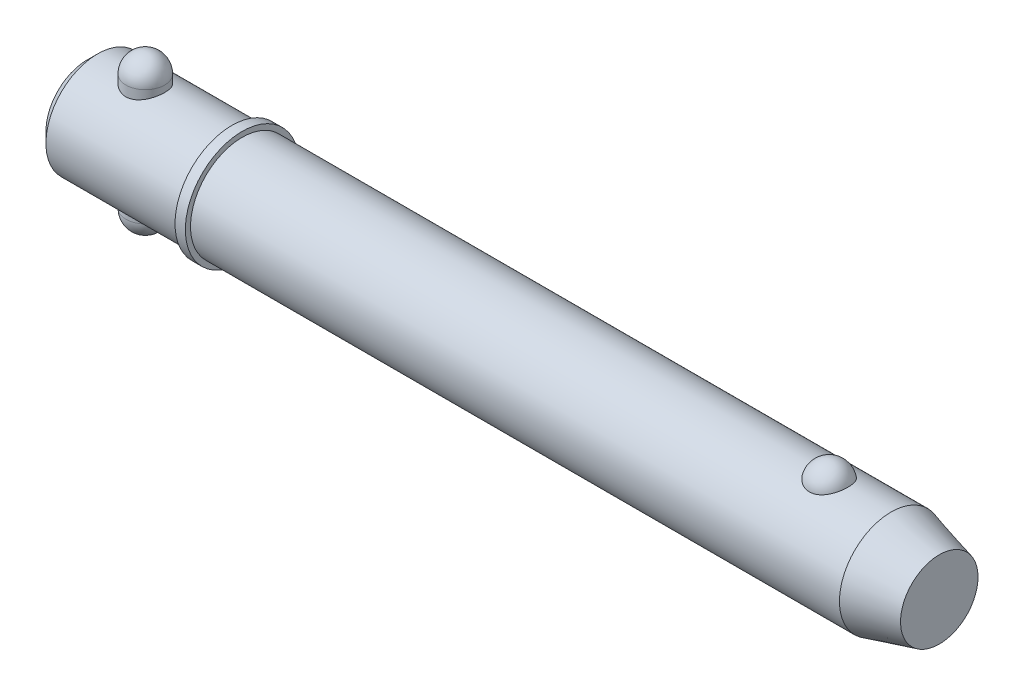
ISO-10303-21;
HEADER;
FILE_DESCRIPTION(('STEP AP214'),'2;1');
FILE_NAME('part.step','',(''),(''),'','','');
FILE_SCHEMA(('AUTOMOTIVE_DESIGN { 1 0 10303 214 1 1 1 1 }'));
ENDSEC;
DATA;
#1=APPLICATION_CONTEXT('core data for automotive mechanical design processes');
#2=APPLICATION_PROTOCOL_DEFINITION('international standard','automotive_design',2000,#1);
#3=PRODUCT_CONTEXT('',#1,'mechanical');
#4=PRODUCT('Part','Part','',(#3));
#5=PRODUCT_RELATED_PRODUCT_CATEGORY('part','',(#4));
#6=PRODUCT_DEFINITION_FORMATION('','',#4);
#7=PRODUCT_DEFINITION_CONTEXT('part definition',#1,'design');
#8=PRODUCT_DEFINITION('design','',#6,#7);
#9=PRODUCT_DEFINITION_SHAPE('','',#8);
#10=(LENGTH_UNIT() NAMED_UNIT(*) SI_UNIT(.MILLI.,.METRE.));
#11=(NAMED_UNIT(*) PLANE_ANGLE_UNIT() SI_UNIT($,.RADIAN.));
#12=(NAMED_UNIT(*) SI_UNIT($,.STERADIAN.) SOLID_ANGLE_UNIT());
#13=UNCERTAINTY_MEASURE_WITH_UNIT(LENGTH_MEASURE(1.E-05),#10,'distance_accuracy_value','');
#14=(GEOMETRIC_REPRESENTATION_CONTEXT(3) GLOBAL_UNCERTAINTY_ASSIGNED_CONTEXT((#13)) GLOBAL_UNIT_ASSIGNED_CONTEXT((#10,
#11,#12)) REPRESENTATION_CONTEXT('',''));
#15=CARTESIAN_POINT('',(0.,0.,0.));
#16=DIRECTION('',(0.,0.,1.));
#17=DIRECTION('',(1.,0.,0.));
#18=AXIS2_PLACEMENT_3D('',#15,#16,#17);
#19=CARTESIAN_POINT('',(14.28,19.05,0.));
#20=DIRECTION('',(0.,-1.,0.));
#21=DIRECTION('',(0.,0.,-1.));
#22=AXIS2_PLACEMENT_3D('',#19,#20,#21);
#23=CYLINDRICAL_SURFACE('',#22,4.76);
#24=CARTESIAN_POINT('',(14.28,-14.29,0.));
#25=DIRECTION('',(0.,-1.,0.));
#26=DIRECTION('',(0.,0.,-1.));
#27=AXIS2_PLACEMENT_3D('',#24,#25,#26);
#28=CIRCLE('',#27,4.76);
#29=CARTESIAN_POINT('',(14.28,-14.29,-4.76));
#30=VERTEX_POINT('',#29);
#31=EDGE_CURVE('P0_E10',#30,#30,#28,.F.);
#32=CARTESIAN_POINT('',(14.28,14.29,0.));
#33=DIRECTION('',(0.,-1.,0.));
#34=DIRECTION('',(0.,0.,-1.));
#35=AXIS2_PLACEMENT_3D('',#32,#33,#34);
#36=CIRCLE('',#35,4.76);
#37=CARTESIAN_POINT('',(14.28,14.29,-4.76));
#38=VERTEX_POINT('',#37);
#39=EDGE_CURVE('P0_E21',#38,#38,#36,.T.);
#40=CARTESIAN_POINT('',(14.28,-14.29,-4.76));
#41=CARTESIAN_POINT('',(14.28,-13.9922916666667,-4.76));
#42=CARTESIAN_POINT('',(14.28,-13.6945833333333,-4.76));
#43=CARTESIAN_POINT('',(14.28,-13.0991666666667,-4.76));
#44=CARTESIAN_POINT('',(14.28,-12.8014583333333,-4.76));
#45=CARTESIAN_POINT('',(14.28,-12.2060416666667,-4.76));
#46=CARTESIAN_POINT('',(14.28,-11.9083333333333,-4.76));
#47=CARTESIAN_POINT('',(14.28,-11.3129166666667,-4.76));
#48=CARTESIAN_POINT('',(14.28,-11.0152083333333,-4.76));
#49=CARTESIAN_POINT('',(14.28,-10.4197916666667,-4.76));
#50=CARTESIAN_POINT('',(14.28,-10.1220833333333,-4.76));
#51=CARTESIAN_POINT('',(14.28,-9.52666666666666,-4.76));
#52=CARTESIAN_POINT('',(14.28,-9.22895833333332,-4.76));
#53=CARTESIAN_POINT('',(14.28,-8.63354166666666,-4.76));
#54=CARTESIAN_POINT('',(14.28,-8.33583333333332,-4.76));
#55=CARTESIAN_POINT('',(14.28,-7.74041666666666,-4.76));
#56=CARTESIAN_POINT('',(14.28,-7.44270833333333,-4.76));
#57=CARTESIAN_POINT('',(14.28,-6.84729166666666,-4.76));
#58=CARTESIAN_POINT('',(14.28,-6.54958333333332,-4.76));
#59=CARTESIAN_POINT('',(14.28,-5.95416666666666,-4.76));
#60=CARTESIAN_POINT('',(14.28,-5.65645833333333,-4.76));
#61=CARTESIAN_POINT('',(14.28,-5.06104166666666,-4.76));
#62=CARTESIAN_POINT('',(14.28,-4.76333333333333,-4.76));
#63=CARTESIAN_POINT('',(14.28,-4.16791666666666,-4.76));
#64=CARTESIAN_POINT('',(14.28,-3.87020833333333,-4.76));
#65=CARTESIAN_POINT('',(14.28,-3.27479166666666,-4.76));
#66=CARTESIAN_POINT('',(14.28,-2.97708333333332,-4.76));
#67=CARTESIAN_POINT('',(14.28,-2.38166666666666,-4.76));
#68=CARTESIAN_POINT('',(14.28,-2.08395833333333,-4.76));
#69=CARTESIAN_POINT('',(14.28,-1.48854166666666,-4.76));
#70=CARTESIAN_POINT('',(14.28,-1.19083333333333,-4.76));
#71=CARTESIAN_POINT('',(14.28,-0.595416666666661,-4.76));
#72=CARTESIAN_POINT('',(14.28,-0.297708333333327,-4.76));
#73=CARTESIAN_POINT('',(14.28,0.297708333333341,-4.76));
#74=CARTESIAN_POINT('',(14.28,0.595416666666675,-4.76));
#75=CARTESIAN_POINT('',(14.28,1.19083333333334,-4.76));
#76=CARTESIAN_POINT('',(14.28,1.48854166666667,-4.76));
#77=CARTESIAN_POINT('',(14.28,2.08395833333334,-4.76));
#78=CARTESIAN_POINT('',(14.28,2.38166666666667,-4.76));
#79=CARTESIAN_POINT('',(14.28,2.97708333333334,-4.76));
#80=CARTESIAN_POINT('',(14.28,3.27479166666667,-4.76));
#81=CARTESIAN_POINT('',(14.28,3.87020833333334,-4.76));
#82=CARTESIAN_POINT('',(14.28,4.16791666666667,-4.76));
#83=CARTESIAN_POINT('',(14.28,4.76333333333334,-4.76));
#84=CARTESIAN_POINT('',(14.28,5.06104166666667,-4.76));
#85=CARTESIAN_POINT('',(14.28,5.65645833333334,-4.76));
#86=CARTESIAN_POINT('',(14.28,5.95416666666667,-4.76));
#87=CARTESIAN_POINT('',(14.28,6.54958333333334,-4.76));
#88=CARTESIAN_POINT('',(14.28,6.84729166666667,-4.76));
#89=CARTESIAN_POINT('',(14.28,7.44270833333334,-4.76));
#90=CARTESIAN_POINT('',(14.28,7.74041666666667,-4.76));
#91=CARTESIAN_POINT('',(14.28,8.33583333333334,-4.76));
#92=CARTESIAN_POINT('',(14.28,8.63354166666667,-4.76));
#93=CARTESIAN_POINT('',(14.28,9.22895833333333,-4.76));
#94=CARTESIAN_POINT('',(14.28,9.52666666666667,-4.76));
#95=CARTESIAN_POINT('',(14.28,10.1220833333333,-4.76));
#96=CARTESIAN_POINT('',(14.28,10.4197916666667,-4.76));
#97=CARTESIAN_POINT('',(14.28,11.0152083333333,-4.76));
#98=CARTESIAN_POINT('',(14.28,11.3129166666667,-4.76));
#99=CARTESIAN_POINT('',(14.28,11.9083333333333,-4.76));
#100=CARTESIAN_POINT('',(14.28,12.2060416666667,-4.76));
#101=CARTESIAN_POINT('',(14.28,12.8014583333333,-4.76));
#102=CARTESIAN_POINT('',(14.28,13.0991666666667,-4.76));
#103=CARTESIAN_POINT('',(14.28,13.6945833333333,-4.76));
#104=CARTESIAN_POINT('',(14.28,13.9922916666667,-4.76));
#105=CARTESIAN_POINT('',(14.28,14.29,-4.76));
#106=B_SPLINE_CURVE_WITH_KNOTS('',3,(#40,#41,#42,#43,#44,#45,#46,#47,#48,#49,#50,#51,#52,#53,
#54,#55,#56,#57,#58,#59,#60,#61,#62,#63,#64,#65,#66,#67,#68,#69,#70,#71,#72,#73,#74,#75,#76,#77,
#78,#79,#80,#81,#82,#83,#84,#85,#86,#87,#88,#89,#90,#91,#92,#93,#94,#95,#96,#97,#98,#99,#100,
#101,#102,#103,#104,#105),.UNSPECIFIED.,.F.,.F.,(4,2,2,2,2,2,2,2,2,2,2,2,2,2,2,2,2,2,2,2,2,2,2,
2,2,2,2,2,2,2,2,2,4),(0.,0.893125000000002,1.78625,2.67937499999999,3.5725,4.465625,5.35875,
6.25187499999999,7.145,8.038125,8.93125,9.82437499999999,10.7175,11.610625,12.50375,13.396875,
14.29,15.183125,16.07625,16.969375,17.8625,18.755625,19.64875,20.541875,21.435,22.328125,
23.22125,24.114375,25.0075,25.900625,26.79375,27.686875,28.58),.UNSPECIFIED.);
#107=EDGE_CURVE('P0_BSEAM14',#30,#38,#106,.T.);
#108=ORIENTED_EDGE('',*,*,#31,.T.);
#109=ORIENTED_EDGE('',*,*,#39,.T.);
#110=ORIENTED_EDGE('',*,*,#107,.T.);
#111=ORIENTED_EDGE('',*,*,#107,.F.);
#112=EDGE_LOOP('',(#108,#110,#109,#111));
#113=FACE_BOUND('',#112,.T.);
#114=ADVANCED_FACE('P0_F14',(#113),#23,.T.);
#115=CARTESIAN_POINT('',(14.28,-14.29,0.));
#116=DIRECTION('',(0.,0.,1.));
#117=DIRECTION('',(1.,0.,0.));
#118=AXIS2_PLACEMENT_3D('',#115,#116,#117);
#119=SPHERICAL_SURFACE('',#118,4.76);
#120=CARTESIAN_POINT('',(14.28,-14.29,0.));
#121=DIRECTION('',(0.,-1.,0.));
#122=DIRECTION('',(0.,0.,-1.));
#123=AXIS2_PLACEMENT_3D('',#120,#121,#122);
#124=SPHERICAL_SURFACE('',#123,4.76);
#125=ORIENTED_EDGE('',*,*,#31,.F.);
#126=EDGE_LOOP('',(#125));
#127=FACE_BOUND('',#126,.T.);
#128=ADVANCED_FACE('P0_F29',(#127),#124,.T.);
#129=CARTESIAN_POINT('',(14.28,14.29,0.));
#130=DIRECTION('',(0.,0.,1.));
#131=DIRECTION('',(1.,0.,0.));
#132=AXIS2_PLACEMENT_3D('',#129,#130,#131);
#133=SPHERICAL_SURFACE('',#132,4.76);
#134=CARTESIAN_POINT('',(14.28,14.29,0.));
#135=DIRECTION('',(0.,-1.,0.));
#136=DIRECTION('',(0.,0.,-1.));
#137=AXIS2_PLACEMENT_3D('',#134,#135,#136);
#138=SPHERICAL_SURFACE('',#137,4.76);
#139=ORIENTED_EDGE('',*,*,#39,.F.);
#140=EDGE_LOOP('',(#139));
#141=FACE_BOUND('',#140,.T.);
#142=ADVANCED_FACE('P0_F16',(#141),#138,.T.);
#143=CLOSED_SHELL('',(#114,#128,#142));
#144=MANIFOLD_SOLID_BREP('P0_B1',#143);
#145=CARTESIAN_POINT('',(0.,0.,0.));
#146=DIRECTION('',(1.,0.,0.));
#147=DIRECTION('',(0.,0.,-1.));
#148=AXIS2_PLACEMENT_3D('',#145,#146,#147);
#149=CYLINDRICAL_SURFACE('',#148,12.7);
#150=CARTESIAN_POINT('',(197.700738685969,0.,0.));
#151=DIRECTION('',(1.,0.,0.));
#152=DIRECTION('',(0.,0.,-1.));
#153=AXIS2_PLACEMENT_3D('',#150,#151,#152);
#154=CIRCLE('',#153,12.7);
#155=CARTESIAN_POINT('',(197.700738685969,0.,-12.7));
#156=VERTEX_POINT('',#155);
#157=EDGE_CURVE('P1_E81',#156,#156,#154,.T.);
#158=ORIENTED_EDGE('',*,*,#157,.F.);
#159=EDGE_LOOP('',(#158));
#160=FACE_BOUND('',#159,.T.);
#161=CARTESIAN_POINT('',(38.1,0.,0.));
#162=DIRECTION('',(1.,0.,0.));
#163=DIRECTION('',(0.,0.,-1.));
#164=AXIS2_PLACEMENT_3D('',#161,#162,#163);
#165=CIRCLE('',#164,12.7);
#166=CARTESIAN_POINT('',(38.1,0.,-12.7));
#167=VERTEX_POINT('',#166);
#168=EDGE_CURVE('P1_E85',#167,#167,#165,.T.);
#169=ORIENTED_EDGE('',*,*,#168,.T.);
#170=EDGE_LOOP('',(#169));
#171=FACE_BOUND('',#170,.T.);
#172=CARTESIAN_POINT('',(182.460042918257,11.7500437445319,4.81938502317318));
#173=CARTESIAN_POINT('',(182.335088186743,11.7500430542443,4.81938571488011));
#174=CARTESIAN_POINT('',(182.210144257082,11.7520975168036,4.81438658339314));
#175=CARTESIAN_POINT('',(181.961142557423,11.760253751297,4.79442904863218));
#176=CARTESIAN_POINT('',(181.837085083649,11.7663568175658,4.77946746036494));
#177=CARTESIAN_POINT('',(181.590901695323,11.7824262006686,4.73971414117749));
#178=CARTESIAN_POINT('',(181.468774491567,11.7923898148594,4.71492928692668));
#179=CARTESIAN_POINT('',(181.227187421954,11.8158938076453,4.65571340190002));
#180=CARTESIAN_POINT('',(181.10772859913,11.8294355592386,4.6212786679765));
#181=CARTESIAN_POINT('',(180.872557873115,11.8596812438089,4.54309502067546));
#182=CARTESIAN_POINT('',(180.756839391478,11.8763792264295,4.49936361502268));
#183=CARTESIAN_POINT('',(180.529653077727,11.9124878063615,4.40287235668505));
#184=CARTESIAN_POINT('',(180.418186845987,11.9318994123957,4.35010914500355));
#185=CARTESIAN_POINT('',(180.091278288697,11.9934256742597,4.17881316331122));
#186=CARTESIAN_POINT('',(179.883127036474,12.038858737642,4.04720756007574));
#187=CARTESIAN_POINT('',(179.485850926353,12.1352173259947,3.748564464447));
#188=CARTESIAN_POINT('',(179.297443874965,12.1862630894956,3.58061821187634));
#189=CARTESIAN_POINT('',(178.950521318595,12.2875163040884,3.21600758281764));
#190=CARTESIAN_POINT('',(178.792011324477,12.3377235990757,3.01933792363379));
#191=CARTESIAN_POINT('',(178.50168878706,12.4344923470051,2.592916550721));
#192=CARTESIAN_POINT('',(178.371376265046,12.4807925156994,2.36208286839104));
#193=CARTESIAN_POINT('',(178.149407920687,12.5623454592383,1.88070399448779));
#194=CARTESIAN_POINT('',(178.057755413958,12.5975972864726,1.63015711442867));
#195=CARTESIAN_POINT('',(177.914046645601,12.6538414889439,1.1129886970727));
#196=CARTESIAN_POINT('',(177.862499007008,12.6746503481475,0.846205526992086));
#197=CARTESIAN_POINT('',(177.801977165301,12.699153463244,0.307085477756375));
#198=CARTESIAN_POINT('',(177.793001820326,12.7028481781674,0.0347487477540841));
#199=CARTESIAN_POINT('',(177.817731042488,12.6927785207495,-0.506073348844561));
#200=CARTESIAN_POINT('',(177.851189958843,12.6791146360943,-0.774571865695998));
#201=CARTESIAN_POINT('',(177.959687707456,12.635882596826,-1.30170246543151));
#202=CARTESIAN_POINT('',(178.03472729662,12.606314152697,-1.56033436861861));
#203=CARTESIAN_POINT('',(178.22500006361,12.5342328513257,-2.06083899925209));
#204=CARTESIAN_POINT('',(178.340287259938,12.4917026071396,-2.30268867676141));
#205=CARTESIAN_POINT('',(178.608704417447,12.3981123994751,-2.76259600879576));
#206=CARTESIAN_POINT('',(178.761837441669,12.3470517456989,-2.98065173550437));
#207=CARTESIAN_POINT('',(179.103507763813,12.2416045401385,-3.38786328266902));
#208=CARTESIAN_POINT('',(179.292201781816,12.1872040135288,-3.57688418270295));
#209=CARTESIAN_POINT('',(179.700239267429,12.0814086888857,-3.91941073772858));
#210=CARTESIAN_POINT('',(179.919580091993,12.0300136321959,-4.07291945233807));
#211=CARTESIAN_POINT('',(180.378375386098,11.9373542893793,-4.33691289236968));
#212=CARTESIAN_POINT('',(180.617304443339,11.8958982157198,-4.44824125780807));
#213=CARTESIAN_POINT('',(181.11243761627,11.8268116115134,-4.62881985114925));
#214=CARTESIAN_POINT('',(181.368635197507,11.7991758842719,-4.69808589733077));
#215=CARTESIAN_POINT('',(181.877164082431,11.7622209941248,-4.78983181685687));
#216=CARTESIAN_POINT('',(182.129041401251,11.7520502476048,-4.81449025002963));
#217=CARTESIAN_POINT('',(182.633573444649,11.7485796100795,-4.82295735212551));
#218=CARTESIAN_POINT('',(182.886228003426,11.7552763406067,-4.80677420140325));
#219=CARTESIAN_POINT('',(183.376834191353,11.7842584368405,-4.73525430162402));
#220=CARTESIAN_POINT('',(183.614998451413,11.8060486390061,-4.68116061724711));
#221=CARTESIAN_POINT('',(184.078489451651,11.8622750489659,-4.53678133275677));
#222=CARTESIAN_POINT('',(184.303815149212,11.8967122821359,-4.44649279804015));
#223=CARTESIAN_POINT('',(184.740801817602,11.9754603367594,-4.22987613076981));
#224=CARTESIAN_POINT('',(184.952057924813,12.0199699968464,-4.10280539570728));
#225=CARTESIAN_POINT('',(185.350601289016,12.1138028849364,-3.81685409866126));
#226=CARTESIAN_POINT('',(185.537883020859,12.163127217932,-3.65796622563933));
#227=CARTESIAN_POINT('',(185.893350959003,12.2642343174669,-3.30364864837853));
#228=CARTESIAN_POINT('',(186.060111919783,12.3160165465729,-3.10678783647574));
#229=CARTESIAN_POINT('',(186.359579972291,12.4142566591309,-2.68748409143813));
#230=CARTESIAN_POINT('',(186.492280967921,12.4607135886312,-2.46503658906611));
#231=CARTESIAN_POINT('',(186.724691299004,12.5450236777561,-1.9928951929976));
#232=CARTESIAN_POINT('',(186.823215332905,12.5825557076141,-1.74255918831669));
#233=CARTESIAN_POINT('',(186.979227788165,12.6431720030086,-1.22773734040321));
#234=CARTESIAN_POINT('',(187.036715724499,12.6662560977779,-0.963251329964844));
#235=CARTESIAN_POINT('',(187.109544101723,12.6956486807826,-0.427355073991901));
#236=CARTESIAN_POINT('',(187.124837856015,12.7019385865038,-0.155937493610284));
#237=CARTESIAN_POINT('',(187.112779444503,12.6970201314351,0.385928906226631));
#238=CARTESIAN_POINT('',(187.08542805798,12.6858120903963,0.656377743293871));
#239=CARTESIAN_POINT('',(187.013060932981,12.6568455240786,1.05454017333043));
#240=CARTESIAN_POINT('',(186.983796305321,12.6451962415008,1.185778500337));
#241=CARTESIAN_POINT('',(186.915022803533,12.6181819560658,1.44513808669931));
#242=CARTESIAN_POINT('',(186.875517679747,12.6028183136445,1.57326046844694));
#243=CARTESIAN_POINT('',(186.786439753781,12.568754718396,1.82554978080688));
#244=CARTESIAN_POINT('',(186.736862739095,12.5500533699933,1.94971503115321));
#245=CARTESIAN_POINT('',(186.62792115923,12.5098093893,2.19314370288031));
#246=CARTESIAN_POINT('',(186.568560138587,12.4882677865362,2.31240887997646));
#247=CARTESIAN_POINT('',(186.43997128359,12.4427679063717,2.54593031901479));
#248=CARTESIAN_POINT('',(186.370688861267,12.4187964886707,2.66015396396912));
#249=CARTESIAN_POINT('',(186.222903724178,12.3691892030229,2.88202659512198));
#250=CARTESIAN_POINT('',(186.144404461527,12.3435539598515,2.98967802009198));
#251=CARTESIAN_POINT('',(185.978550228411,12.2912955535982,3.19774385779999));
#252=CARTESIAN_POINT('',(185.891191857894,12.2646720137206,3.298155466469));
#253=CARTESIAN_POINT('',(185.708161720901,12.2111945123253,3.49095035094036));
#254=CARTESIAN_POINT('',(185.612493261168,12.1843406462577,3.58333679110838));
#255=CARTESIAN_POINT('',(185.413627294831,12.1312249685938,3.75922876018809));
#256=CARTESIAN_POINT('',(185.310450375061,12.104961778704,3.84275713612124));
#257=CARTESIAN_POINT('',(185.09701336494,12.0537284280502,4.00056406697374));
#258=CARTESIAN_POINT('',(184.986756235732,12.028757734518,4.07484645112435));
#259=CARTESIAN_POINT('',(184.759755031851,11.9808306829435,4.21367959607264));
#260=CARTESIAN_POINT('',(184.643006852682,11.9578756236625,4.27822410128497));
#261=CARTESIAN_POINT('',(184.40394258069,11.9147184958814,4.39698483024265));
#262=CARTESIAN_POINT('',(184.281628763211,11.894515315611,4.45120522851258));
#263=CARTESIAN_POINT('',(184.022952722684,11.8561129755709,4.55255353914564));
#264=CARTESIAN_POINT('',(183.886223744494,11.8381764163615,4.59884858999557));
#265=CARTESIAN_POINT('',(183.608608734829,11.8069093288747,4.67853897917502));
#266=CARTESIAN_POINT('',(183.467724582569,11.7935767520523,4.71194005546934));
#267=CARTESIAN_POINT('',(183.18309446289,11.7720277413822,4.76552188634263));
#268=CARTESIAN_POINT('',(183.039348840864,11.7638106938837,4.78570422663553));
#269=CARTESIAN_POINT('',(182.750411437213,11.7528195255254,4.81263433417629));
#270=CARTESIAN_POINT('',(182.605219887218,11.7500445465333,4.81938421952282));
#271=CARTESIAN_POINT('',(182.460042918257,11.7500437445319,4.81938502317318));
#272=B_SPLINE_CURVE_WITH_KNOTS('',3,(#172,#173,#174,#175,#176,#177,#178,#179,#180,#181,#182,
#183,#184,#185,#186,#187,#188,#189,#190,#191,#192,#193,#194,#195,#196,#197,#198,#199,#200,#201,
#202,#203,#204,#205,#206,#207,#208,#209,#210,#211,#212,#213,#214,#215,#216,#217,#218,#219,#220,
#221,#222,#223,#224,#225,#226,#227,#228,#229,#230,#231,#232,#233,#234,#235,#236,#237,#238,#239,
#240,#241,#242,#243,#244,#245,#246,#247,#248,#249,#250,#251,#252,#253,#254,#255,#256,#257,#258,
#259,#260,#261,#262,#263,#264,#265,#266,#267,#268,#269,#270,#271),.UNSPECIFIED.,.T.,.F.,(4,2,2,
2,2,2,2,2,2,2,2,2,2,2,2,2,2,2,2,2,2,2,2,2,2,2,2,2,2,2,2,2,2,2,2,2,2,2,2,2,2,2,2,2,2,2,2,2,2,4),
(0.,0.374729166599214,0.749578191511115,1.12416526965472,1.49889629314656,1.87292776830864,
2.24709865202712,2.99481328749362,3.76399449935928,4.53331735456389,5.3368391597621,
6.14042986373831,6.95405296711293,7.76765424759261,8.57656703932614,9.38549455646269,
10.1955119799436,11.0055949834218,11.8193353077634,12.6330054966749,13.4294141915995,
14.2255231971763,14.9815786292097,15.7374826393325,16.4696948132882,17.2019663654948,
17.9501979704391,18.6986017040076,19.484470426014,20.2704797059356,21.0815215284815,
21.8925729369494,22.7045213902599,23.5164550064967,23.9209608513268,24.3253187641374,
24.7298461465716,25.1342272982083,25.54092555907,25.9474719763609,26.3541750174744,
26.7607169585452,27.1661834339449,27.5714814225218,27.9770386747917,28.3824315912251,
28.8181206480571,29.2536155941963,29.6890582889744,30.1244323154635),.UNSPECIFIED.);
#273=CARTESIAN_POINT('',(182.460042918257,11.7500437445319,4.81938502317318));
#274=VERTEX_POINT('',#273);
#275=EDGE_CURVE('P1_E35',#274,#274,#272,.T.);
#276=ORIENTED_EDGE('',*,*,#275,.T.);
#277=EDGE_LOOP('',(#276));
#278=FACE_BOUND('',#277,.T.);
#279=ADVANCED_FACE('P1_F13',(#160,#171,#278),#149,.T.);
#280=CARTESIAN_POINT('',(0.,0.,0.));
#281=DIRECTION('',(-1.,0.,0.));
#282=DIRECTION('',(0.,0.,1.));
#283=AXIS2_PLACEMENT_3D('',#280,#281,#282);
#284=PLANE('',#283);
#285=CARTESIAN_POINT('',(0.,0.,0.));
#286=DIRECTION('',(1.,0.,0.));
#287=DIRECTION('',(0.,0.,-1.));
#288=AXIS2_PLACEMENT_3D('',#285,#286,#287);
#289=CIRCLE('',#288,10.16);
#290=CARTESIAN_POINT('',(0.,0.,-10.16));
#291=VERTEX_POINT('',#290);
#292=EDGE_CURVE('P1_E9',#291,#291,#289,.T.);
#293=ORIENTED_EDGE('',*,*,#292,.F.);
#294=EDGE_LOOP('',(#293));
#295=FACE_BOUND('',#294,.T.);
#296=ADVANCED_FACE('P1_F15',(#295),#284,.T.);
#297=CARTESIAN_POINT('',(2.53999999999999,0.,0.));
#298=DIRECTION('',(1.,0.,0.));
#299=DIRECTION('',(0.,0.,-1.));
#300=AXIS2_PLACEMENT_3D('',#297,#298,#299);
#301=CONICAL_SURFACE('',#300,12.7,0.78539816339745);
#302=ORIENTED_EDGE('',*,*,#292,.T.);
#303=EDGE_LOOP('',(#302));
#304=FACE_BOUND('',#303,.T.);
#305=CARTESIAN_POINT('',(2.53999999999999,0.,0.));
#306=DIRECTION('',(1.,0.,0.));
#307=DIRECTION('',(0.,0.,-1.));
#308=AXIS2_PLACEMENT_3D('',#305,#306,#307);
#309=CIRCLE('',#308,12.7);
#310=CARTESIAN_POINT('',(2.53999999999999,0.,-12.7));
#311=VERTEX_POINT('',#310);
#312=EDGE_CURVE('P1_E26',#311,#311,#309,.T.);
#313=ORIENTED_EDGE('',*,*,#312,.F.);
#314=EDGE_LOOP('',(#313));
#315=FACE_BOUND('',#314,.T.);
#316=ADVANCED_FACE('P1_F77',(#304,#315),#301,.T.);
#317=CARTESIAN_POINT('',(0.,0.,0.));
#318=DIRECTION('',(1.,0.,0.));
#319=DIRECTION('',(0.,0.,-1.));
#320=AXIS2_PLACEMENT_3D('',#317,#318,#319);
#321=CYLINDRICAL_SURFACE('',#320,12.7);
#322=CARTESIAN_POINT('',(14.28,-11.7742260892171,4.76));
#323=CARTESIAN_POINT('',(14.1514948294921,-11.7742255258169,4.76000061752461));
#324=CARTESIAN_POINT('',(14.0229980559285,-11.7763355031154,4.75479194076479));
#325=CARTESIAN_POINT('',(13.7669369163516,-11.7847043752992,4.73401198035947));
#326=CARTESIAN_POINT('',(13.6393728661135,-11.7909646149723,4.71843733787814));
#327=CARTESIAN_POINT('',(13.386226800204,-11.8074248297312,4.67709434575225));
#328=CARTESIAN_POINT('',(13.2606439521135,-11.8176231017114,4.65133040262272));
#329=CARTESIAN_POINT('',(13.0122434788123,-11.8416347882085,4.58985545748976));
#330=CARTESIAN_POINT('',(12.8894269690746,-11.8554496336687,4.55414051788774));
#331=CARTESIAN_POINT('',(12.6477622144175,-11.8862222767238,4.47320764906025));
#332=CARTESIAN_POINT('',(12.5289037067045,-11.9031710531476,4.4280169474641));
#333=CARTESIAN_POINT('',(12.2955059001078,-11.939736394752,4.32845291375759));
#334=CARTESIAN_POINT('',(12.1809682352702,-11.9593539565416,4.2740761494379));
#335=CARTESIAN_POINT('',(11.8448901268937,-12.0213893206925,4.09777237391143));
#336=CARTESIAN_POINT('',(11.6307077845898,-12.0670135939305,3.9626122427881));
#337=CARTESIAN_POINT('',(11.2179129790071,-12.1641514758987,3.65386230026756));
#338=CARTESIAN_POINT('',(11.0204399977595,-12.2158379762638,3.47881300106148));
#339=CARTESIAN_POINT('',(10.6568212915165,-12.3178468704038,3.09829182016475));
#340=CARTESIAN_POINT('',(10.4906822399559,-12.3681689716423,2.89281347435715));
#341=CARTESIAN_POINT('',(10.1890299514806,-12.4638367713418,2.44867909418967));
#342=CARTESIAN_POINT('',(10.054749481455,-12.5089552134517,2.20913281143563));
#343=CARTESIAN_POINT('',(9.82886079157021,-12.5870472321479,1.70885919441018));
#344=CARTESIAN_POINT('',(9.73723778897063,-12.620025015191,1.44813923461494));
#345=CARTESIAN_POINT('',(9.60324488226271,-12.6688874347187,0.9248423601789));
#346=CARTESIAN_POINT('',(9.55892269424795,-12.6854474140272,0.662829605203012));
#347=CARTESIAN_POINT('',(9.5145335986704,-12.7020320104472,0.134596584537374));
#348=CARTESIAN_POINT('',(9.5144523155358,-12.7020619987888,-0.131622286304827));
#349=CARTESIAN_POINT('',(9.55741019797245,-12.6860129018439,-0.646717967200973));
#350=CARTESIAN_POINT('',(9.59831845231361,-12.6707298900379,-0.895801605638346));
#351=CARTESIAN_POINT('',(9.71850987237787,-12.6268158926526,-1.38327219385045));
#352=CARTESIAN_POINT('',(9.79779575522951,-12.5981839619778,-1.62165838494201));
#353=CARTESIAN_POINT('',(9.99348296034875,-12.5298894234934,-2.08508424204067));
#354=CARTESIAN_POINT('',(10.110407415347,-12.4900724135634,-2.30987931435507));
#355=CARTESIAN_POINT('',(10.3775896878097,-12.4034373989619,-2.7372158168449));
#356=CARTESIAN_POINT('',(10.5278582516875,-12.3566171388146,-2.93975004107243));
#357=CARTESIAN_POINT('',(10.8677318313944,-12.257571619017,-3.32936830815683));
#358=CARTESIAN_POINT('',(11.0591227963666,-12.2051903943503,-3.51485714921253));
#359=CARTESIAN_POINT('',(11.4706087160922,-12.1031155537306,-3.85170663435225));
#360=CARTESIAN_POINT('',(11.6907108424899,-12.0534226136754,-4.00305872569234));
#361=CARTESIAN_POINT('',(12.1596597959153,-11.9613684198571,-4.27038218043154));
#362=CARTESIAN_POINT('',(12.4090353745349,-11.9191939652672,-4.38549550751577));
#363=CARTESIAN_POINT('',(12.9256290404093,-11.8491124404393,-4.57149117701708));
#364=CARTESIAN_POINT('',(13.1928371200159,-11.8211974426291,-4.64239810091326));
#365=CARTESIAN_POINT('',(13.7217488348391,-11.7846654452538,-4.73434137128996));
#366=CARTESIAN_POINT('',(13.9829438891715,-11.7750694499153,-4.75791141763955));
#367=CARTESIAN_POINT('',(14.5056760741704,-11.7734909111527,-4.76182097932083));
#368=CARTESIAN_POINT('',(14.7672131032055,-11.7815039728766,-4.74217128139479));
#369=CARTESIAN_POINT('',(15.2702140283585,-11.8132466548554,-4.66249544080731));
#370=CARTESIAN_POINT('',(15.5120417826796,-11.8362133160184,-4.60442726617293));
#371=CARTESIAN_POINT('',(15.9824097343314,-11.8943704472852,-4.45202868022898));
#372=CARTESIAN_POINT('',(16.2109472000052,-11.9295634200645,-4.35769084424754));
#373=CARTESIAN_POINT('',(16.6577741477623,-12.0098310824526,-4.13144368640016));
#374=CARTESIAN_POINT('',(16.8753590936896,-12.055226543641,-3.99825937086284));
#375=CARTESIAN_POINT('',(17.2859732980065,-12.150238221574,-3.69949845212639));
#376=CARTESIAN_POINT('',(17.4789935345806,-12.19985597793,-3.5339100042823));
#377=CARTESIAN_POINT('',(17.8477707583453,-12.3015434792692,-3.1624728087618));
#378=CARTESIAN_POINT('',(18.0216609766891,-12.3535695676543,-2.95473880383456));
#379=CARTESIAN_POINT('',(18.254545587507,-12.426745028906,-2.62277433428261));
#380=CARTESIAN_POINT('',(18.3275489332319,-12.4503382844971,-2.50865480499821));
#381=CARTESIAN_POINT('',(18.463723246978,-12.4952713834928,-2.27428971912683));
#382=CARTESIAN_POINT('',(18.5268984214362,-12.5166121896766,-2.15404681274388));
#383=CARTESIAN_POINT('',(18.6427140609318,-12.5563817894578,-1.90858448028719));
#384=CARTESIAN_POINT('',(18.6953855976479,-12.5748191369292,-1.78338108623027));
#385=CARTESIAN_POINT('',(18.7899337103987,-12.6083284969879,-1.52857834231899));
#386=CARTESIAN_POINT('',(18.8318147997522,-12.6234019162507,-1.39898085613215));
#387=CARTESIAN_POINT('',(18.9043819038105,-12.6497495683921,-1.13633254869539));
#388=CARTESIAN_POINT('',(18.9350698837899,-12.6610244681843,-1.00328233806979));
#389=CARTESIAN_POINT('',(18.9849303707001,-12.6794412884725,-0.734761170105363));
#390=CARTESIAN_POINT('',(19.0041035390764,-12.6865834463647,-0.59929035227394));
#391=CARTESIAN_POINT('',(19.0299427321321,-12.6962286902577,-0.335006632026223));
#392=CARTESIAN_POINT('',(19.0372742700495,-12.698978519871,-0.206267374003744));
#393=CARTESIAN_POINT('',(19.0414668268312,-12.7005496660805,0.0514515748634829));
#394=CARTESIAN_POINT('',(19.038324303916,-12.69936965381,0.180431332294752));
#395=CARTESIAN_POINT('',(19.0215965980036,-12.6931114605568,0.437551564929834));
#396=CARTESIAN_POINT('',(19.0080165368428,-12.6880351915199,0.565692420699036));
#397=CARTESIAN_POINT('',(18.9705519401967,-12.6741222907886,0.820297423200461));
#398=CARTESIAN_POINT('',(18.9466635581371,-12.665284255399,0.946760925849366));
#399=CARTESIAN_POINT('',(18.8895279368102,-12.6443449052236,1.19395899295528));
#400=CARTESIAN_POINT('',(18.8565273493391,-12.6323299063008,1.3147578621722));
#401=CARTESIAN_POINT('',(18.781239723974,-12.6052503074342,1.55308888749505));
#402=CARTESIAN_POINT('',(18.738949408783,-12.5901846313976,1.67061987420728));
#403=CARTESIAN_POINT('',(18.5986461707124,-12.5409473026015,2.01714406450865));
#404=CARTESIAN_POINT('',(18.4871532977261,-12.502717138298,2.24027279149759));
#405=CARTESIAN_POINT('',(18.2262440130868,-12.4173042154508,2.6742599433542));
#406=CARTESIAN_POINT('',(18.0754310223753,-12.3698127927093,2.88420891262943));
#407=CARTESIAN_POINT('',(17.7421836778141,-12.271667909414,3.27675114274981));
#408=CARTESIAN_POINT('',(17.5597380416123,-12.2210133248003,3.45933459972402));
#409=CARTESIAN_POINT('',(17.2605468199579,-12.1452079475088,3.7138066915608));
#410=CARTESIAN_POINT('',(17.1535518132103,-12.119328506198,3.79719993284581));
#411=CARTESIAN_POINT('',(16.9326449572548,-12.0688597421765,3.95467398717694));
#412=CARTESIAN_POINT('',(16.8187356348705,-12.0442699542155,4.02875817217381));
#413=CARTESIAN_POINT('',(16.5846234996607,-11.9971053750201,4.16711104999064));
#414=CARTESIAN_POINT('',(16.4644172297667,-11.9745317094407,4.23137427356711));
#415=CARTESIAN_POINT('',(16.2185866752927,-11.9321360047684,4.34949041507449));
#416=CARTESIAN_POINT('',(16.09296473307,-11.9123127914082,4.40334777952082));
#417=CARTESIAN_POINT('',(15.8314769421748,-11.875268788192,4.50232278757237));
#418=CARTESIAN_POINT('',(15.6954035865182,-11.8582009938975,4.54695127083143));
#419=CARTESIAN_POINT('',(15.4194002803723,-11.8284328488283,4.62383807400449));
#420=CARTESIAN_POINT('',(15.2794720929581,-11.815730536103,4.6561019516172));
#421=CARTESIAN_POINT('',(14.9969657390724,-11.7951940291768,4.70788444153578));
#422=CARTESIAN_POINT('',(14.8543884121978,-11.7873583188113,4.72740702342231));
#423=CARTESIAN_POINT('',(14.5678704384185,-11.7768749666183,4.75346370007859));
#424=CARTESIAN_POINT('',(14.4239299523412,-11.7742267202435,4.75999930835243));
#425=CARTESIAN_POINT('',(14.28,-11.7742260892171,4.76));
#426=B_SPLINE_CURVE_WITH_KNOTS('',3,(#322,#323,#324,#325,#326,#327,#328,#329,#330,#331,#332,
#333,#334,#335,#336,#337,#338,#339,#340,#341,#342,#343,#344,#345,#346,#347,#348,#349,#350,#351,
#352,#353,#354,#355,#356,#357,#358,#359,#360,#361,#362,#363,#364,#365,#366,#367,#368,#369,#370,
#371,#372,#373,#374,#375,#376,#377,#378,#379,#380,#381,#382,#383,#384,#385,#386,#387,#388,#389,
#390,#391,#392,#393,#394,#395,#396,#397,#398,#399,#400,#401,#402,#403,#404,#405,#406,#407,#408,
#409,#410,#411,#412,#413,#414,#415,#416,#417,#418,#419,#420,#421,#422,#423,#424,#425),
.UNSPECIFIED.,.T.,.F.,(4,2,2,2,2,2,2,2,2,2,2,2,2,2,2,2,2,2,2,2,2,2,2,2,2,2,2,2,2,2,2,2,2,2,2,2,
2,2,2,2,2,2,2,2,2,2,2,2,2,2,2,4),(0.,0.385378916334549,0.770882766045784,1.15622008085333,
1.54171009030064,1.92610725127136,2.31064835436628,3.07917291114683,3.88239385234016,
4.68578566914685,5.51648193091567,6.34689010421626,7.14151420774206,7.93588010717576,
8.69098665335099,9.44614666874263,10.2122918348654,10.9786842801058,11.789876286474,
12.6012713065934,13.4306405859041,14.2595482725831,15.0427613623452,15.8257790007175,
16.5716820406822,17.3177378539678,18.0917395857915,18.8660247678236,19.6893332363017,
20.1014571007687,20.5134040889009,20.9241137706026,21.3346513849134,21.7451168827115,
22.1555587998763,22.542011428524,22.928594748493,23.3149884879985,23.7015265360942,
24.0784835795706,24.4555738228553,25.2091300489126,25.994347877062,26.7798463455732,
27.1937428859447,27.6074890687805,28.0214648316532,28.4352633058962,28.8672794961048,
29.299101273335,29.7307884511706,30.1624253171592),.UNSPECIFIED.);
#427=CARTESIAN_POINT('',(14.28,-11.7742260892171,4.76));
#428=VERTEX_POINT('',#427);
#429=EDGE_CURVE('P1_E17',#428,#428,#426,.T.);
#430=ORIENTED_EDGE('',*,*,#429,.F.);
#431=EDGE_LOOP('',(#430));
#432=FACE_BOUND('',#431,.T.);
#433=CARTESIAN_POINT('',(14.28,11.7742260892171,4.76));
#434=CARTESIAN_POINT('',(14.4085051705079,11.7742255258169,4.76000061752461));
#435=CARTESIAN_POINT('',(14.5370019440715,11.7763355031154,4.75479194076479));
#436=CARTESIAN_POINT('',(14.7930630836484,11.7847043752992,4.73401198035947));
#437=CARTESIAN_POINT('',(14.9206271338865,11.7909646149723,4.71843733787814));
#438=CARTESIAN_POINT('',(15.173773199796,11.8074248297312,4.67709434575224));
#439=CARTESIAN_POINT('',(15.2993560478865,11.8176231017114,4.65133040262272));
#440=CARTESIAN_POINT('',(15.5477565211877,11.8416347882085,4.58985545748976));
#441=CARTESIAN_POINT('',(15.6705730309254,11.8554496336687,4.55414051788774));
#442=CARTESIAN_POINT('',(15.9122377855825,11.8862222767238,4.47320764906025));
#443=CARTESIAN_POINT('',(16.0310962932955,11.9031710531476,4.4280169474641));
#444=CARTESIAN_POINT('',(16.2644940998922,11.939736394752,4.32845291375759));
#445=CARTESIAN_POINT('',(16.3790317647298,11.9593539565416,4.2740761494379));
#446=CARTESIAN_POINT('',(16.7151098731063,12.0213893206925,4.09777237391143));
#447=CARTESIAN_POINT('',(16.9292922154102,12.0670135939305,3.96261224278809));
#448=CARTESIAN_POINT('',(17.3420870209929,12.1641514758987,3.65386230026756));
#449=CARTESIAN_POINT('',(17.5395600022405,12.2158379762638,3.47881300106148));
#450=CARTESIAN_POINT('',(17.9031787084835,12.3178468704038,3.09829182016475));
#451=CARTESIAN_POINT('',(18.0693177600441,12.3681689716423,2.89281347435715));
#452=CARTESIAN_POINT('',(18.3709700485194,12.4638367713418,2.44867909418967));
#453=CARTESIAN_POINT('',(18.505250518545,12.5089552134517,2.20913281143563));
#454=CARTESIAN_POINT('',(18.7311392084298,12.5870472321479,1.70885919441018));
#455=CARTESIAN_POINT('',(18.8227622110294,12.620025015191,1.44813923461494));
#456=CARTESIAN_POINT('',(18.9567551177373,12.6688874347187,0.924842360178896));
#457=CARTESIAN_POINT('',(19.0010773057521,12.6854474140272,0.662829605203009));
#458=CARTESIAN_POINT('',(19.0454664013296,12.7020320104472,0.134596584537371));
#459=CARTESIAN_POINT('',(19.0455476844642,12.7020619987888,-0.13162228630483));
#460=CARTESIAN_POINT('',(19.0025898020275,12.6860129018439,-0.646717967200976));
#461=CARTESIAN_POINT('',(18.9616815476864,12.6707298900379,-0.89580160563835));
#462=CARTESIAN_POINT('',(18.8414901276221,12.6268158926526,-1.38327219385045));
#463=CARTESIAN_POINT('',(18.7622042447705,12.5981839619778,-1.62165838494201));
#464=CARTESIAN_POINT('',(18.5665170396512,12.5298894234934,-2.08508424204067));
#465=CARTESIAN_POINT('',(18.449592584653,12.4900724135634,-2.30987931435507));
#466=CARTESIAN_POINT('',(18.1824103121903,12.4034373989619,-2.7372158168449));
#467=CARTESIAN_POINT('',(18.0321417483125,12.3566171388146,-2.93975004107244));
#468=CARTESIAN_POINT('',(17.6922681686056,12.257571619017,-3.32936830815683));
#469=CARTESIAN_POINT('',(17.5008772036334,12.2051903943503,-3.51485714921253));
#470=CARTESIAN_POINT('',(17.0893912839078,12.1031155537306,-3.85170663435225));
#471=CARTESIAN_POINT('',(16.8692891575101,12.0534226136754,-4.00305872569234));
#472=CARTESIAN_POINT('',(16.4003402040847,11.9613684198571,-4.27038218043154));
#473=CARTESIAN_POINT('',(16.1509646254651,11.9191939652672,-4.38549550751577));
#474=CARTESIAN_POINT('',(15.6343709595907,11.8491124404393,-4.57149117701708));
#475=CARTESIAN_POINT('',(15.367162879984,11.8211974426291,-4.64239810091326));
#476=CARTESIAN_POINT('',(14.8382511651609,11.7846654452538,-4.73434137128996));
#477=CARTESIAN_POINT('',(14.5770561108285,11.7750694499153,-4.75791141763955));
#478=CARTESIAN_POINT('',(14.0543239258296,11.7734909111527,-4.76182097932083));
#479=CARTESIAN_POINT('',(13.7927868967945,11.7815039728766,-4.74217128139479));
#480=CARTESIAN_POINT('',(13.2897859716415,11.8132466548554,-4.66249544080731));
#481=CARTESIAN_POINT('',(13.0479582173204,11.8362133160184,-4.60442726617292));
#482=CARTESIAN_POINT('',(12.5775902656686,11.8943704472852,-4.45202868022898));
#483=CARTESIAN_POINT('',(12.3490527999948,11.9295634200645,-4.35769084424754));
#484=CARTESIAN_POINT('',(11.9022258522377,12.0098310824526,-4.13144368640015));
#485=CARTESIAN_POINT('',(11.6846409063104,12.055226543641,-3.99825937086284));
#486=CARTESIAN_POINT('',(11.2740267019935,12.150238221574,-3.69949845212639));
#487=CARTESIAN_POINT('',(11.0810064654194,12.19985597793,-3.5339100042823));
#488=CARTESIAN_POINT('',(10.7122292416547,12.3015434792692,-3.1624728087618));
#489=CARTESIAN_POINT('',(10.5383390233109,12.3535695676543,-2.95473880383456));
#490=CARTESIAN_POINT('',(10.305454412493,12.426745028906,-2.6227743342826));
#491=CARTESIAN_POINT('',(10.2324510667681,12.4503382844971,-2.50865480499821));
#492=CARTESIAN_POINT('',(10.096276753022,12.4952713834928,-2.27428971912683));
#493=CARTESIAN_POINT('',(10.0331015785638,12.5166121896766,-2.15404681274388));
#494=CARTESIAN_POINT('',(9.91728593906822,12.5563817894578,-1.90858448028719));
#495=CARTESIAN_POINT('',(9.8646144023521,12.5748191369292,-1.78338108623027));
#496=CARTESIAN_POINT('',(9.77006628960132,12.6083284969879,-1.52857834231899));
#497=CARTESIAN_POINT('',(9.72818520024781,12.6234019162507,-1.39898085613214));
#498=CARTESIAN_POINT('',(9.65561809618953,12.6497495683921,-1.13633254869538));
#499=CARTESIAN_POINT('',(9.62493011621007,12.6610244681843,-1.00328233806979));
#500=CARTESIAN_POINT('',(9.57506962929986,12.6794412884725,-0.734761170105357));
#501=CARTESIAN_POINT('',(9.55589646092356,12.6865834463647,-0.599290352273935));
#502=CARTESIAN_POINT('',(9.53005726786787,12.6962286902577,-0.335006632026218));
#503=CARTESIAN_POINT('',(9.52272572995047,12.698978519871,-0.20626737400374));
#504=CARTESIAN_POINT('',(9.51853317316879,12.7005496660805,0.0514515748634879));
#505=CARTESIAN_POINT('',(9.52167569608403,12.69936965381,0.180431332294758));
#506=CARTESIAN_POINT('',(9.53840340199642,12.6931114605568,0.43755156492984));
#507=CARTESIAN_POINT('',(9.55198346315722,12.6880351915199,0.565692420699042));
#508=CARTESIAN_POINT('',(9.58944805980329,12.6741222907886,0.820297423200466));
#509=CARTESIAN_POINT('',(9.61333644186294,12.665284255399,0.946760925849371));
#510=CARTESIAN_POINT('',(9.67047206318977,12.6443449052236,1.19395899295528));
#511=CARTESIAN_POINT('',(9.7034726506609,12.6323299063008,1.31475786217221));
#512=CARTESIAN_POINT('',(9.77876027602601,12.6052503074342,1.55308888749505));
#513=CARTESIAN_POINT('',(9.82105059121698,12.5901846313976,1.67061987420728));
#514=CARTESIAN_POINT('',(9.96135382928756,12.5409473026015,2.01714406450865));
#515=CARTESIAN_POINT('',(10.0728467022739,12.502717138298,2.24027279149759));
#516=CARTESIAN_POINT('',(10.3337559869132,12.4173042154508,2.6742599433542));
#517=CARTESIAN_POINT('',(10.4845689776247,12.3698127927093,2.88420891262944));
#518=CARTESIAN_POINT('',(10.8178163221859,12.271667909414,3.27675114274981));
#519=CARTESIAN_POINT('',(11.0002619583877,12.2210133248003,3.45933459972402));
#520=CARTESIAN_POINT('',(11.2994531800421,12.1452079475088,3.7138066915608));
#521=CARTESIAN_POINT('',(11.4064481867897,12.119328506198,3.79719993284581));
#522=CARTESIAN_POINT('',(11.6273550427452,12.0688597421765,3.95467398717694));
#523=CARTESIAN_POINT('',(11.7412643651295,12.0442699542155,4.02875817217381));
#524=CARTESIAN_POINT('',(11.9753765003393,11.9971053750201,4.16711104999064));
#525=CARTESIAN_POINT('',(12.0955827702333,11.9745317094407,4.23137427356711));
#526=CARTESIAN_POINT('',(12.3414133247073,11.9321360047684,4.34949041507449));
#527=CARTESIAN_POINT('',(12.46703526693,11.9123127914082,4.40334777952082));
#528=CARTESIAN_POINT('',(12.7285230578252,11.875268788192,4.50232278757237));
#529=CARTESIAN_POINT('',(12.8645964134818,11.8582009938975,4.54695127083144));
#530=CARTESIAN_POINT('',(13.1405997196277,11.8284328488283,4.62383807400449));
#531=CARTESIAN_POINT('',(13.2805279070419,11.815730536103,4.6561019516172));
#532=CARTESIAN_POINT('',(13.5630342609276,11.7951940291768,4.70788444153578));
#533=CARTESIAN_POINT('',(13.7056115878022,11.7873583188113,4.72740702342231));
#534=CARTESIAN_POINT('',(13.9921295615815,11.7768749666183,4.75346370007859));
#535=CARTESIAN_POINT('',(14.1360700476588,11.7742267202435,4.75999930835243));
#536=CARTESIAN_POINT('',(14.28,11.7742260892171,4.76));
#537=B_SPLINE_CURVE_WITH_KNOTS('',3,(#433,#434,#435,#436,#437,#438,#439,#440,#441,#442,#443,
#444,#445,#446,#447,#448,#449,#450,#451,#452,#453,#454,#455,#456,#457,#458,#459,#460,#461,#462,
#463,#464,#465,#466,#467,#468,#469,#470,#471,#472,#473,#474,#475,#476,#477,#478,#479,#480,#481,
#482,#483,#484,#485,#486,#487,#488,#489,#490,#491,#492,#493,#494,#495,#496,#497,#498,#499,#500,
#501,#502,#503,#504,#505,#506,#507,#508,#509,#510,#511,#512,#513,#514,#515,#516,#517,#518,#519,
#520,#521,#522,#523,#524,#525,#526,#527,#528,#529,#530,#531,#532,#533,#534,#535,#536),
.UNSPECIFIED.,.T.,.F.,(4,2,2,2,2,2,2,2,2,2,2,2,2,2,2,2,2,2,2,2,2,2,2,2,2,2,2,2,2,2,2,2,2,2,2,2,
2,2,2,2,2,2,2,2,2,2,2,2,2,2,2,4),(0.,0.385378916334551,0.770882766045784,1.15622008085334,
1.54171009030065,1.92610725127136,2.31064835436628,3.07917291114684,3.88239385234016,
4.68578566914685,5.51648193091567,6.34689010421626,7.14151420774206,7.93588010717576,
8.690986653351,9.44614666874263,10.2122918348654,10.9786842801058,11.789876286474,
12.6012713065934,13.4306405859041,14.2595482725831,15.0427613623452,15.8257790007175,
16.5716820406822,17.3177378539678,18.0917395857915,18.8660247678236,19.6893332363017,
20.1014571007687,20.5134040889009,20.9241137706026,21.3346513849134,21.7451168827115,
22.1555587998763,22.542011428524,22.928594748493,23.3149884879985,23.7015265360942,
24.0784835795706,24.4555738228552,25.2091300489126,25.994347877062,26.7798463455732,
27.1937428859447,27.6074890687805,28.0214648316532,28.4352633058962,28.8672794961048,
29.299101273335,29.7307884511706,30.1624253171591),.UNSPECIFIED.);
#538=CARTESIAN_POINT('',(14.28,11.7742260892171,4.76));
#539=VERTEX_POINT('',#538);
#540=EDGE_CURVE('P1_E43',#539,#539,#537,.T.);
#541=ORIENTED_EDGE('',*,*,#540,.F.);
#542=EDGE_LOOP('',(#541));
#543=FACE_BOUND('',#542,.T.);
#544=ORIENTED_EDGE('',*,*,#312,.T.);
#545=EDGE_LOOP('',(#544));
#546=FACE_BOUND('',#545,.T.);
#547=CARTESIAN_POINT('',(35.56,0.,0.));
#548=DIRECTION('',(1.,0.,0.));
#549=DIRECTION('',(0.,0.,-1.));
#550=AXIS2_PLACEMENT_3D('',#547,#548,#549);
#551=CIRCLE('',#550,12.7);
#552=CARTESIAN_POINT('',(35.56,0.,-12.7));
#553=VERTEX_POINT('',#552);
#554=EDGE_CURVE('P1_E31',#553,#553,#551,.T.);
#555=ORIENTED_EDGE('',*,*,#554,.F.);
#556=EDGE_LOOP('',(#555));
#557=FACE_BOUND('',#556,.T.);
#558=ADVANCED_FACE('P1_F103',(#432,#543,#546,#557),#321,.T.);
#559=CARTESIAN_POINT('',(35.56,12.7,0.));
#560=DIRECTION('',(-1.,0.,0.));
#561=DIRECTION('',(0.,0.,1.));
#562=AXIS2_PLACEMENT_3D('',#559,#560,#561);
#563=PLANE('',#562);
#564=ORIENTED_EDGE('',*,*,#554,.T.);
#565=EDGE_LOOP('',(#564));
#566=FACE_BOUND('',#565,.T.);
#567=CARTESIAN_POINT('',(35.56,0.,0.));
#568=DIRECTION('',(1.,0.,0.));
#569=DIRECTION('',(0.,0.,-1.));
#570=AXIS2_PLACEMENT_3D('',#567,#568,#569);
#571=CIRCLE('',#570,13.97);
#572=CARTESIAN_POINT('',(35.56,0.,-13.97));
#573=VERTEX_POINT('',#572);
#574=EDGE_CURVE('P1_E91',#573,#573,#571,.T.);
#575=ORIENTED_EDGE('',*,*,#574,.F.);
#576=EDGE_LOOP('',(#575));
#577=FACE_BOUND('',#576,.T.);
#578=ADVANCED_FACE('P1_F100',(#566,#577),#563,.T.);
#579=CARTESIAN_POINT('',(0.,0.,0.));
#580=DIRECTION('',(1.,0.,0.));
#581=DIRECTION('',(0.,0.,-1.));
#582=AXIS2_PLACEMENT_3D('',#579,#580,#581);
#583=CYLINDRICAL_SURFACE('',#582,13.97);
#584=ORIENTED_EDGE('',*,*,#574,.T.);
#585=EDGE_LOOP('',(#584));
#586=FACE_BOUND('',#585,.T.);
#587=CARTESIAN_POINT('',(38.1,0.,0.));
#588=DIRECTION('',(1.,0.,0.));
#589=DIRECTION('',(0.,0.,-1.));
#590=AXIS2_PLACEMENT_3D('',#587,#588,#589);
#591=CIRCLE('',#590,13.97);
#592=CARTESIAN_POINT('',(38.1,0.,-13.97));
#593=VERTEX_POINT('',#592);
#594=EDGE_CURVE('P1_E88',#593,#593,#591,.T.);
#595=ORIENTED_EDGE('',*,*,#594,.F.);
#596=EDGE_LOOP('',(#595));
#597=FACE_BOUND('',#596,.T.);
#598=ADVANCED_FACE('P1_F68',(#586,#597),#583,.T.);
#599=CARTESIAN_POINT('',(38.1,13.97,0.));
#600=DIRECTION('',(1.,0.,0.));
#601=DIRECTION('',(0.,0.,-1.));
#602=AXIS2_PLACEMENT_3D('',#599,#600,#601);
#603=PLANE('',#602);
#604=ORIENTED_EDGE('',*,*,#594,.T.);
#605=EDGE_LOOP('',(#604));
#606=FACE_BOUND('',#605,.T.);
#607=ORIENTED_EDGE('',*,*,#168,.F.);
#608=EDGE_LOOP('',(#607));
#609=FACE_BOUND('',#608,.T.);
#610=ADVANCED_FACE('P1_F62',(#606,#609),#603,.T.);
#611=CARTESIAN_POINT('',(209.55,0.,0.));
#612=DIRECTION('',(-1.,0.,0.));
#613=DIRECTION('',(0.,0.,1.));
#614=AXIS2_PLACEMENT_3D('',#611,#612,#613);
#615=CONICAL_SURFACE('',#614,9.52500000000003,0.261799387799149);
#616=ORIENTED_EDGE('',*,*,#157,.T.);
#617=EDGE_LOOP('',(#616));
#618=FACE_BOUND('',#617,.T.);
#619=CARTESIAN_POINT('',(209.55,0.,0.));
#620=DIRECTION('',(1.,0.,0.));
#621=DIRECTION('',(0.,0.,-1.));
#622=AXIS2_PLACEMENT_3D('',#619,#620,#621);
#623=CIRCLE('',#622,9.52500000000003);
#624=CARTESIAN_POINT('',(209.55,0.,-9.52500000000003));
#625=VERTEX_POINT('',#624);
#626=EDGE_CURVE('P1_E42',#625,#625,#623,.T.);
#627=ORIENTED_EDGE('',*,*,#626,.F.);
#628=EDGE_LOOP('',(#627));
#629=FACE_BOUND('',#628,.T.);
#630=ADVANCED_FACE('P1_F59',(#618,#629),#615,.T.);
#631=CARTESIAN_POINT('',(209.55,9.52500000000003,0.));
#632=DIRECTION('',(1.,0.,0.));
#633=DIRECTION('',(0.,0.,-1.));
#634=AXIS2_PLACEMENT_3D('',#631,#632,#633);
#635=PLANE('',#634);
#636=ORIENTED_EDGE('',*,*,#626,.T.);
#637=EDGE_LOOP('',(#636));
#638=FACE_BOUND('',#637,.T.);
#639=ADVANCED_FACE('P1_F55',(#638),#635,.T.);
#640=CARTESIAN_POINT('',(182.460042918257,11.43,0.));
#641=DIRECTION('',(-1.,0.,0.));
#642=DIRECTION('',(0.,1.,0.));
#643=AXIS2_PLACEMENT_3D('',#640,#641,#642);
#644=SPHERICAL_SURFACE('',#643,4.83);
#645=ORIENTED_EDGE('',*,*,#275,.F.);
#646=EDGE_LOOP('',(#645));
#647=FACE_BOUND('',#646,.T.);
#648=ADVANCED_FACE('P1_F50',(#647),#644,.T.);
#649=CARTESIAN_POINT('',(14.28,-13.97,0.));
#650=DIRECTION('',(0.,1.,0.));
#651=DIRECTION('',(0.,0.,1.));
#652=AXIS2_PLACEMENT_3D('',#649,#650,#651);
#653=CYLINDRICAL_SURFACE('',#652,4.76);
#654=ORIENTED_EDGE('',*,*,#429,.T.);
#655=EDGE_LOOP('',(#654));
#656=FACE_BOUND('',#655,.T.);
#657=ORIENTED_EDGE('',*,*,#540,.T.);
#658=EDGE_LOOP('',(#657));
#659=FACE_BOUND('',#658,.T.);
#660=ADVANCED_FACE('P1_F54',(#656,#659),#653,.F.);
#661=CLOSED_SHELL('',(#279,#296,#316,#558,#578,#598,#610,#630,#639,#648,#660));
#662=MANIFOLD_SOLID_BREP('P1_B1',#661);
#663=ADVANCED_BREP_SHAPE_REPRESENTATION('',(#18,#144,#662),#14);
#664=SHAPE_DEFINITION_REPRESENTATION(#9,#663);
ENDSEC;
END-ISO-10303-21;
